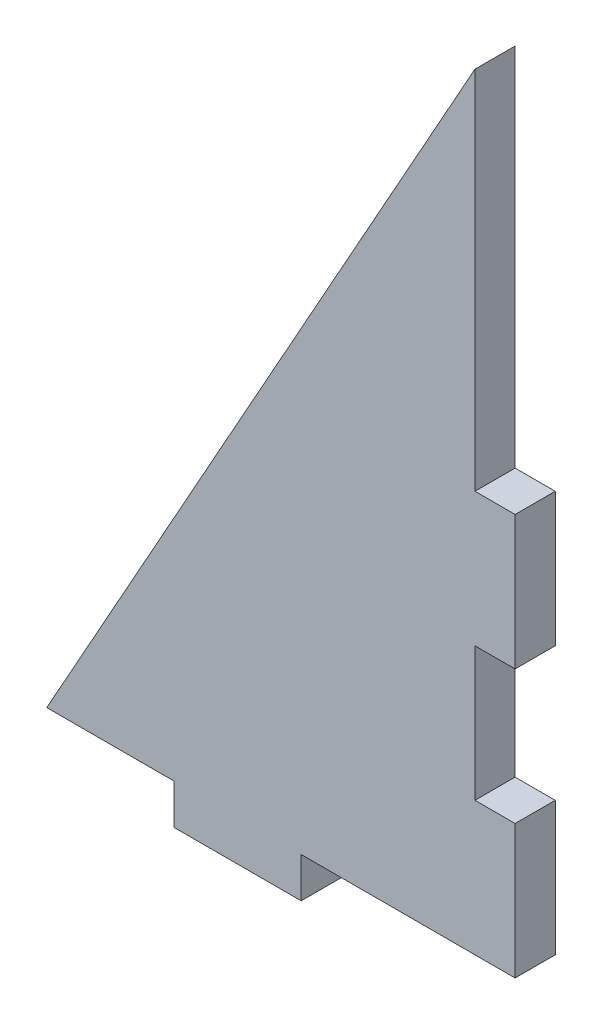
from build123d import *

# Parameters (mm, degrees)
BOSS_EXTRU_1_DEPTH = 3


with BuildPart() as part:
    # Esquisse1 → Boss.-Extru.1 (new body)
    with BuildSketch(Plane.XY):
        Polygon((-32, -17), (-22.492848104, -17), (-22.492848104, -20), (-12.986005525, -20), (-12.986005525, -17), (0, -17), (3, -17), (3, -7), (0, -7), (0, 3), (3, 3), (3, 13), (0, 13), (0, 40.316364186), align=None)
    extrude(amount=BOSS_EXTRU_1_DEPTH)


solid = part.part
